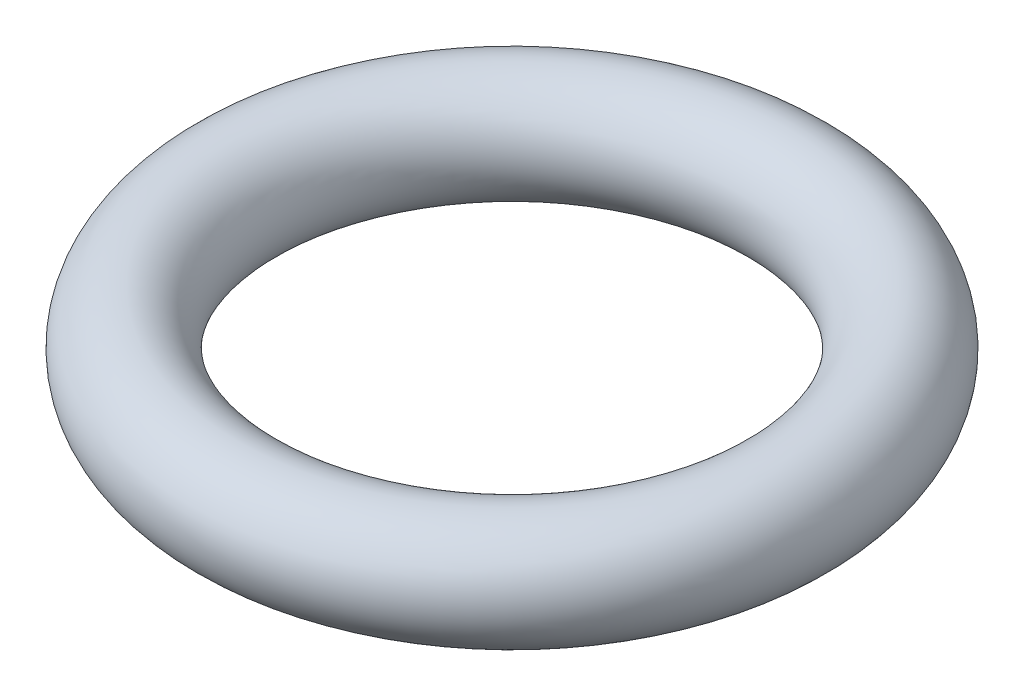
from build123d import *

# Parameters (mm, degrees)
SKETCH1_R = 0.396875


with BuildPart() as part:
    # Sketch1 → Revolve1 (revolve)
    with BuildSketch(Plane.XY, mode=Mode.PRIVATE) as revolve1_sk:
        with Locations((1.984375, 0)):
            Circle(SKETCH1_R)
    revolve(revolve1_sk.sketch.rotate(Axis((0, 0, 0), (0, 1, 0)), 90), axis=Axis((0, 0, 0), (0, 1, 0)))


solid = part.part
